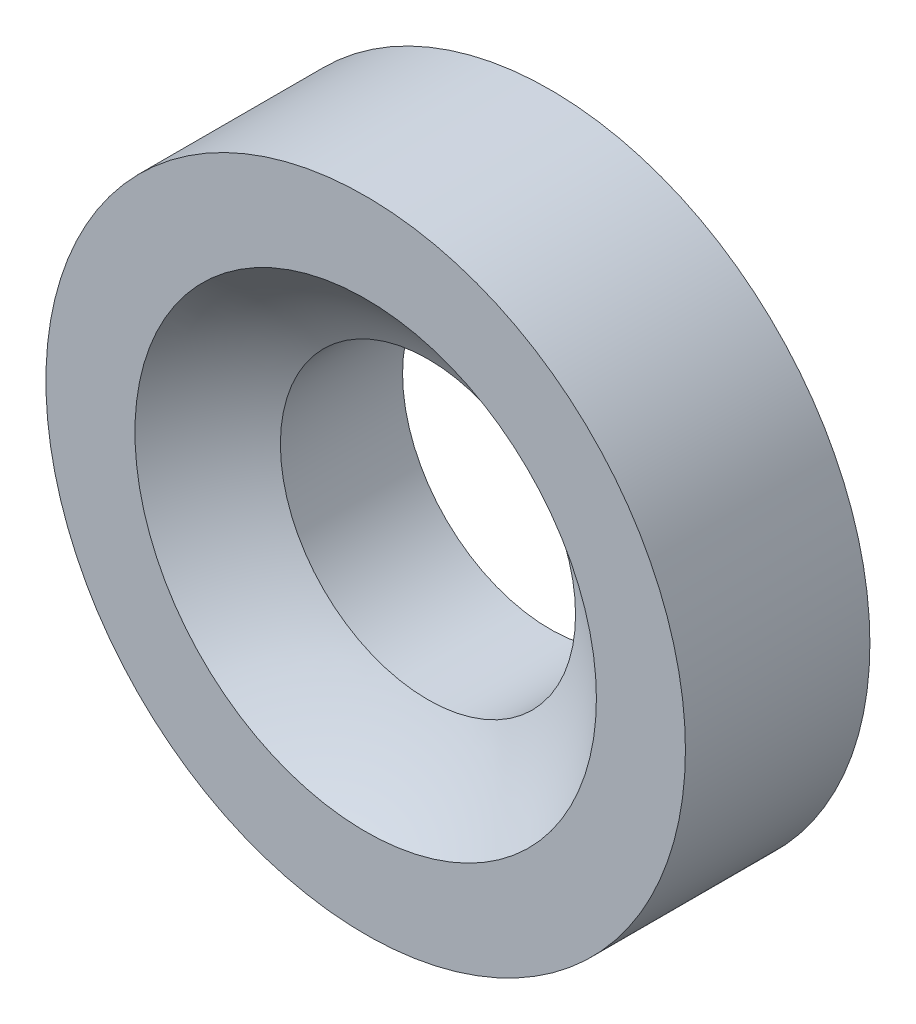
ISO-10303-21;
HEADER;
FILE_DESCRIPTION(('STEP AP214'),'2;1');
FILE_NAME('part.step','',(''),(''),'','','');
FILE_SCHEMA(('AUTOMOTIVE_DESIGN { 1 0 10303 214 1 1 1 1 }'));
ENDSEC;
DATA;
#1=APPLICATION_CONTEXT('core data for automotive mechanical design processes');
#2=APPLICATION_PROTOCOL_DEFINITION('international standard','automotive_design',2000,#1);
#3=PRODUCT_CONTEXT('',#1,'mechanical');
#4=PRODUCT('Part','Part','',(#3));
#5=PRODUCT_RELATED_PRODUCT_CATEGORY('part','',(#4));
#6=PRODUCT_DEFINITION_FORMATION('','',#4);
#7=PRODUCT_DEFINITION_CONTEXT('part definition',#1,'design');
#8=PRODUCT_DEFINITION('design','',#6,#7);
#9=PRODUCT_DEFINITION_SHAPE('','',#8);
#10=(LENGTH_UNIT() NAMED_UNIT(*) SI_UNIT(.MILLI.,.METRE.));
#11=(NAMED_UNIT(*) PLANE_ANGLE_UNIT() SI_UNIT($,.RADIAN.));
#12=(NAMED_UNIT(*) SI_UNIT($,.STERADIAN.) SOLID_ANGLE_UNIT());
#13=UNCERTAINTY_MEASURE_WITH_UNIT(LENGTH_MEASURE(1.E-05),#10,'distance_accuracy_value','');
#14=(GEOMETRIC_REPRESENTATION_CONTEXT(3) GLOBAL_UNCERTAINTY_ASSIGNED_CONTEXT((#13)) GLOBAL_UNIT_ASSIGNED_CONTEXT((#10,
#11,#12)) REPRESENTATION_CONTEXT('',''));
#15=CARTESIAN_POINT('',(0.,0.,0.));
#16=DIRECTION('',(0.,0.,1.));
#17=DIRECTION('',(1.,0.,0.));
#18=AXIS2_PLACEMENT_3D('',#15,#16,#17);
#19=CARTESIAN_POINT('',(0.,0.,7.5));
#20=DIRECTION('',(0.,0.,1.));
#21=DIRECTION('',(1.,0.,0.));
#22=AXIS2_PLACEMENT_3D('',#19,#20,#21);
#23=PLANE('',#22);
#24=CARTESIAN_POINT('',(0.,0.,7.5));
#25=DIRECTION('',(0.,0.,1.));
#26=DIRECTION('',(1.,0.,0.));
#27=AXIS2_PLACEMENT_3D('',#24,#25,#26);
#28=CIRCLE('',#27,13.);
#29=CARTESIAN_POINT('',(13.,0.,7.5));
#30=VERTEX_POINT('',#29);
#31=EDGE_CURVE('E38',#30,#30,#28,.T.);
#32=ORIENTED_EDGE('',*,*,#31,.T.);
#33=EDGE_LOOP('',(#32));
#34=FACE_BOUND('',#33,.T.);
#35=CARTESIAN_POINT('',(0.,0.,7.5));
#36=DIRECTION('',(0.,0.,1.));
#37=DIRECTION('',(1.,0.,0.));
#38=AXIS2_PLACEMENT_3D('',#35,#36,#37);
#39=CIRCLE('',#38,9.38083151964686);
#40=CARTESIAN_POINT('',(9.38083151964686,0.,7.5));
#41=VERTEX_POINT('',#40);
#42=EDGE_CURVE('E10',#41,#41,#39,.F.);
#43=ORIENTED_EDGE('',*,*,#42,.T.);
#44=EDGE_LOOP('',(#43));
#45=FACE_BOUND('',#44,.T.);
#46=ADVANCED_FACE('F30',(#34,#45),#23,.T.);
#47=CARTESIAN_POINT('',(0.,0.,7.5));
#48=DIRECTION('',(0.,0.,-1.));
#49=DIRECTION('',(-1.,0.,0.));
#50=AXIS2_PLACEMENT_3D('',#47,#48,#49);
#51=CYLINDRICAL_SURFACE('',#50,13.);
#52=ORIENTED_EDGE('',*,*,#31,.F.);
#53=EDGE_LOOP('',(#52));
#54=FACE_BOUND('',#53,.T.);
#55=CARTESIAN_POINT('',(0.,0.,0.));
#56=DIRECTION('',(0.,0.,1.));
#57=DIRECTION('',(1.,0.,0.));
#58=AXIS2_PLACEMENT_3D('',#55,#56,#57);
#59=CIRCLE('',#58,13.);
#60=CARTESIAN_POINT('',(13.,0.,0.));
#61=VERTEX_POINT('',#60);
#62=EDGE_CURVE('E42',#61,#61,#59,.T.);
#63=ORIENTED_EDGE('',*,*,#62,.T.);
#64=EDGE_LOOP('',(#63));
#65=FACE_BOUND('',#64,.T.);
#66=ADVANCED_FACE('F32',(#54,#65),#51,.T.);
#67=CARTESIAN_POINT('',(0.,0.,0.));
#68=DIRECTION('',(0.,0.,1.));
#69=DIRECTION('',(1.,0.,0.));
#70=AXIS2_PLACEMENT_3D('',#67,#68,#69);
#71=PLANE('',#70);
#72=CARTESIAN_POINT('',(0.,0.,0.));
#73=DIRECTION('',(0.,0.,-1.));
#74=DIRECTION('',(-1.,0.,0.));
#75=AXIS2_PLACEMENT_3D('',#72,#73,#74);
#76=CIRCLE('',#75,6.);
#77=CARTESIAN_POINT('',(-6.,0.,0.));
#78=VERTEX_POINT('',#77);
#79=EDGE_CURVE('E47',#78,#78,#76,.T.);
#80=ORIENTED_EDGE('',*,*,#79,.F.);
#81=EDGE_LOOP('',(#80));
#82=FACE_BOUND('',#81,.T.);
#83=ORIENTED_EDGE('',*,*,#62,.F.);
#84=EDGE_LOOP('',(#83));
#85=FACE_BOUND('',#84,.T.);
#86=ADVANCED_FACE('F59',(#82,#85),#71,.F.);
#87=CARTESIAN_POINT('',(0.,0.,16.5));
#88=DIRECTION('',(-1.,0.,0.));
#89=DIRECTION('',(0.,0.,-1.));
#90=AXIS2_PLACEMENT_3D('',#87,#88,#89);
#91=SPHERICAL_SURFACE('',#90,13.);
#92=CARTESIAN_POINT('',(0.,0.,16.5));
#93=DIRECTION('',(0.,0.,1.));
#94=DIRECTION('',(1.,0.,0.));
#95=AXIS2_PLACEMENT_3D('',#92,#93,#94);
#96=SPHERICAL_SURFACE('',#95,13.);
#97=CARTESIAN_POINT('',(0.,0.,4.96743740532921));
#98=DIRECTION('',(0.,0.,1.));
#99=DIRECTION('',(1.,0.,0.));
#100=AXIS2_PLACEMENT_3D('',#97,#98,#99);
#101=CIRCLE('',#100,6.);
#102=CARTESIAN_POINT('',(6.,0.,4.96743740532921));
#103=VERTEX_POINT('',#102);
#104=EDGE_CURVE('E34',#103,#103,#101,.T.);
#105=ORIENTED_EDGE('',*,*,#104,.F.);
#106=EDGE_LOOP('',(#105));
#107=FACE_BOUND('',#106,.T.);
#108=ORIENTED_EDGE('',*,*,#42,.F.);
#109=EDGE_LOOP('',(#108));
#110=FACE_BOUND('',#109,.T.);
#111=ADVANCED_FACE('F56',(#107,#110),#96,.F.);
#112=CARTESIAN_POINT('',(0.,0.,7.5));
#113=DIRECTION('',(0.,0.,-1.));
#114=DIRECTION('',(-1.,0.,0.));
#115=AXIS2_PLACEMENT_3D('',#112,#113,#114);
#116=CYLINDRICAL_SURFACE('',#115,6.);
#117=ORIENTED_EDGE('',*,*,#104,.T.);
#118=EDGE_LOOP('',(#117));
#119=FACE_BOUND('',#118,.T.);
#120=ORIENTED_EDGE('',*,*,#79,.T.);
#121=EDGE_LOOP('',(#120));
#122=FACE_BOUND('',#121,.T.);
#123=ADVANCED_FACE('F54',(#119,#122),#116,.F.);
#124=CLOSED_SHELL('',(#46,#66,#86,#111,#123));
#125=MANIFOLD_SOLID_BREP('B2',#124);
#126=ADVANCED_BREP_SHAPE_REPRESENTATION('',(#18,#125),#14);
#127=SHAPE_DEFINITION_REPRESENTATION(#9,#126);
ENDSEC;
END-ISO-10303-21;
